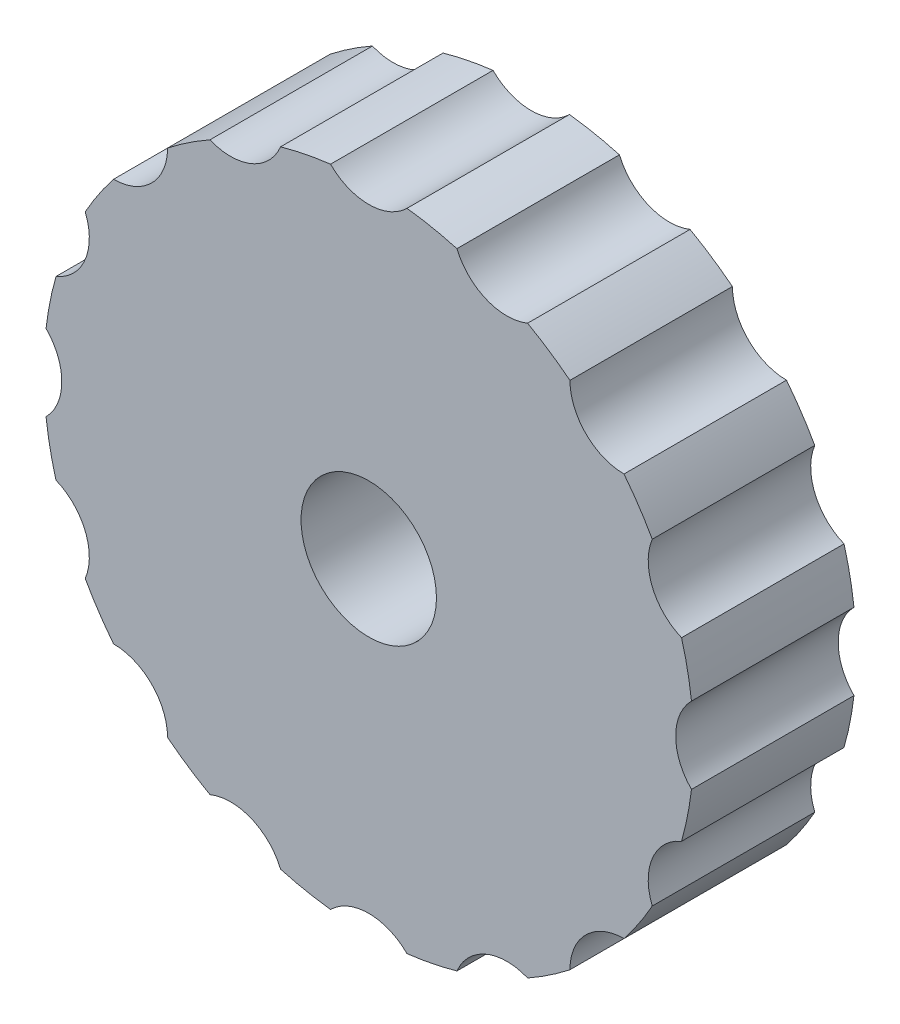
ISO-10303-21;
HEADER;
FILE_DESCRIPTION(('STEP AP214'),'2;1');
FILE_NAME('part.step','',(''),(''),'','','');
FILE_SCHEMA(('AUTOMOTIVE_DESIGN { 1 0 10303 214 1 1 1 1 }'));
ENDSEC;
DATA;
#1=APPLICATION_CONTEXT('core data for automotive mechanical design processes');
#2=APPLICATION_PROTOCOL_DEFINITION('international standard','automotive_design',2000,#1);
#3=PRODUCT_CONTEXT('',#1,'mechanical');
#4=PRODUCT('Part','Part','',(#3));
#5=PRODUCT_RELATED_PRODUCT_CATEGORY('part','',(#4));
#6=PRODUCT_DEFINITION_FORMATION('','',#4);
#7=PRODUCT_DEFINITION_CONTEXT('part definition',#1,'design');
#8=PRODUCT_DEFINITION('design','',#6,#7);
#9=PRODUCT_DEFINITION_SHAPE('','',#8);
#10=(LENGTH_UNIT() NAMED_UNIT(*) SI_UNIT(.MILLI.,.METRE.));
#11=(NAMED_UNIT(*) PLANE_ANGLE_UNIT() SI_UNIT($,.RADIAN.));
#12=(NAMED_UNIT(*) SI_UNIT($,.STERADIAN.) SOLID_ANGLE_UNIT());
#13=UNCERTAINTY_MEASURE_WITH_UNIT(LENGTH_MEASURE(1.E-05),#10,'distance_accuracy_value','');
#14=(GEOMETRIC_REPRESENTATION_CONTEXT(3) GLOBAL_UNCERTAINTY_ASSIGNED_CONTEXT((#13)) GLOBAL_UNIT_ASSIGNED_CONTEXT((#10,
#11,#12)) REPRESENTATION_CONTEXT('',''));
#15=CARTESIAN_POINT('',(0.,0.,0.));
#16=DIRECTION('',(0.,0.,1.));
#17=DIRECTION('',(1.,0.,0.));
#18=AXIS2_PLACEMENT_3D('',#15,#16,#17);
#19=CARTESIAN_POINT('',(0.,0.,9.));
#20=DIRECTION('',(0.,0.,-1.));
#21=DIRECTION('',(-1.,0.,0.));
#22=AXIS2_PLACEMENT_3D('',#19,#20,#21);
#23=CYLINDRICAL_SURFACE('',#22,18.);
#24=CARTESIAN_POINT('',(0.,0.,0.));
#25=DIRECTION('',(0.,0.,1.));
#26=DIRECTION('',(1.,0.,0.));
#27=AXIS2_PLACEMENT_3D('',#24,#25,#26);
#28=CIRCLE('',#27,18.);
#29=CARTESIAN_POINT('',(11.1421401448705,14.1369272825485,0.));
#30=VERTEX_POINT('',#29);
#31=CARTESIAN_POINT('',(8.7969053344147,15.7039630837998,0.));
#32=VERTEX_POINT('',#31);
#33=EDGE_CURVE('E256',#30,#32,#28,.T.);
#34=ORIENTED_EDGE('',*,*,#33,.T.);
#35=DIRECTION('',(0.,0.,-1.));
#36=VECTOR('',#35,1.);
#37=CARTESIAN_POINT('',(8.79690533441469,15.7039630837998,4.5));
#38=LINE('',#37,#36);
#39=CARTESIAN_POINT('',(8.79690533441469,15.7039630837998,9.));
#40=VERTEX_POINT('',#39);
#41=EDGE_CURVE('E49',#40,#32,#38,.T.);
#42=ORIENTED_EDGE('',*,*,#41,.F.);
#43=CARTESIAN_POINT('',(0.,0.,9.));
#44=DIRECTION('',(0.,0.,1.));
#45=DIRECTION('',(1.,0.,0.));
#46=AXIS2_PLACEMENT_3D('',#43,#44,#45);
#47=CIRCLE('',#46,18.);
#48=CARTESIAN_POINT('',(11.1421401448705,14.1369272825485,9.));
#49=VERTEX_POINT('',#48);
#50=EDGE_CURVE('E254',#49,#40,#47,.T.);
#51=ORIENTED_EDGE('',*,*,#50,.F.);
#52=DIRECTION('',(0.,0.,-1.));
#53=VECTOR('',#52,1.);
#54=CARTESIAN_POINT('',(11.1421401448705,14.1369272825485,4.5));
#55=LINE('',#54,#53);
#56=EDGE_CURVE('E391',#30,#49,#55,.F.);
#57=ORIENTED_EDGE('',*,*,#56,.F.);
#58=EDGE_LOOP('',(#34,#42,#51,#57));
#59=FACE_BOUND('',#58,.T.);
#60=ADVANCED_FACE('F32',(#59),#23,.T.);
#61=CARTESIAN_POINT('',(15.7039630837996,8.79690533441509,0.));
#62=VERTEX_POINT('',#61);
#63=CARTESIAN_POINT('',(14.1369272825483,11.1421401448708,0.));
#64=VERTEX_POINT('',#63);
#65=EDGE_CURVE('E401',#62,#64,#28,.T.);
#66=ORIENTED_EDGE('',*,*,#65,.T.);
#67=DIRECTION('',(0.,0.,-1.));
#68=VECTOR('',#67,1.);
#69=CARTESIAN_POINT('',(14.1369272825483,11.1421401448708,4.5));
#70=LINE('',#69,#68);
#71=CARTESIAN_POINT('',(14.1369272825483,11.1421401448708,9.));
#72=VERTEX_POINT('',#71);
#73=EDGE_CURVE('E57',#72,#64,#70,.T.);
#74=ORIENTED_EDGE('',*,*,#73,.F.);
#75=CARTESIAN_POINT('',(15.7039630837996,8.79690533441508,9.));
#76=VERTEX_POINT('',#75);
#77=EDGE_CURVE('E263',#76,#72,#47,.T.);
#78=ORIENTED_EDGE('',*,*,#77,.F.);
#79=DIRECTION('',(0.,0.,-1.));
#80=VECTOR('',#79,1.);
#81=CARTESIAN_POINT('',(15.7039630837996,8.79690533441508,4.5));
#82=LINE('',#81,#80);
#83=EDGE_CURVE('E385',#62,#76,#82,.F.);
#84=ORIENTED_EDGE('',*,*,#83,.F.);
#85=EDGE_LOOP('',(#66,#74,#78,#84));
#86=FACE_BOUND('',#85,.T.);
#87=ADVANCED_FACE('F482',(#86),#23,.T.);
#88=CARTESIAN_POINT('',(17.875,2.11763429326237,0.));
#89=VERTEX_POINT('',#88);
#90=CARTESIAN_POINT('',(17.3247302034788,4.88402737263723,0.));
#91=VERTEX_POINT('',#90);
#92=EDGE_CURVE('E468',#89,#91,#28,.T.);
#93=ORIENTED_EDGE('',*,*,#92,.T.);
#94=DIRECTION('',(0.,0.,-1.));
#95=VECTOR('',#94,1.);
#96=CARTESIAN_POINT('',(17.3247302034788,4.88402737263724,4.5));
#97=LINE('',#96,#95);
#98=CARTESIAN_POINT('',(17.3247302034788,4.88402737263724,9.));
#99=VERTEX_POINT('',#98);
#100=EDGE_CURVE('E383',#99,#91,#97,.T.);
#101=ORIENTED_EDGE('',*,*,#100,.F.);
#102=CARTESIAN_POINT('',(17.875,2.11763429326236,9.));
#103=VERTEX_POINT('',#102);
#104=EDGE_CURVE('E264',#103,#99,#47,.T.);
#105=ORIENTED_EDGE('',*,*,#104,.F.);
#106=DIRECTION('',(0.,0.,-1.));
#107=VECTOR('',#106,1.);
#108=CARTESIAN_POINT('',(17.875,2.11763429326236,4.5));
#109=LINE('',#108,#107);
#110=EDGE_CURVE('E377',#89,#103,#109,.F.);
#111=ORIENTED_EDGE('',*,*,#110,.F.);
#112=EDGE_LOOP('',(#93,#101,#105,#111));
#113=FACE_BOUND('',#112,.T.);
#114=ADVANCED_FACE('F501',(#113),#23,.T.);
#115=CARTESIAN_POINT('',(17.3247302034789,-4.88402737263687,0.));
#116=VERTEX_POINT('',#115);
#117=CARTESIAN_POINT('',(17.875,-2.117634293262,0.));
#118=VERTEX_POINT('',#117);
#119=EDGE_CURVE('E462',#116,#118,#28,.T.);
#120=ORIENTED_EDGE('',*,*,#119,.T.);
#121=DIRECTION('',(0.,0.,-1.));
#122=VECTOR('',#121,1.);
#123=CARTESIAN_POINT('',(17.875,-2.11763429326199,4.5));
#124=LINE('',#123,#122);
#125=CARTESIAN_POINT('',(17.875,-2.11763429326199,9.));
#126=VERTEX_POINT('',#125);
#127=EDGE_CURVE('E375',#126,#118,#124,.T.);
#128=ORIENTED_EDGE('',*,*,#127,.F.);
#129=CARTESIAN_POINT('',(17.3247302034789,-4.88402737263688,9.));
#130=VERTEX_POINT('',#129);
#131=EDGE_CURVE('E809',#130,#126,#47,.T.);
#132=ORIENTED_EDGE('',*,*,#131,.F.);
#133=DIRECTION('',(0.,0.,-1.));
#134=VECTOR('',#133,1.);
#135=CARTESIAN_POINT('',(17.3247302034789,-4.88402737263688,4.5));
#136=LINE('',#135,#134);
#137=EDGE_CURVE('E369',#116,#130,#136,.F.);
#138=ORIENTED_EDGE('',*,*,#137,.F.);
#139=EDGE_LOOP('',(#120,#128,#132,#138));
#140=FACE_BOUND('',#139,.T.);
#141=ADVANCED_FACE('F549',(#140),#23,.T.);
#142=CARTESIAN_POINT('',(14.1369272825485,-11.1421401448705,0.));
#143=VERTEX_POINT('',#142);
#144=CARTESIAN_POINT('',(15.7039630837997,-8.79690533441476,0.));
#145=VERTEX_POINT('',#144);
#146=EDGE_CURVE('E456',#143,#145,#28,.T.);
#147=ORIENTED_EDGE('',*,*,#146,.T.);
#148=DIRECTION('',(0.,0.,-1.));
#149=VECTOR('',#148,1.);
#150=CARTESIAN_POINT('',(15.7039630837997,-8.79690533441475,4.5));
#151=LINE('',#150,#149);
#152=CARTESIAN_POINT('',(15.7039630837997,-8.79690533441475,9.));
#153=VERTEX_POINT('',#152);
#154=EDGE_CURVE('E367',#153,#145,#151,.T.);
#155=ORIENTED_EDGE('',*,*,#154,.F.);
#156=CARTESIAN_POINT('',(14.1369272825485,-11.1421401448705,9.));
#157=VERTEX_POINT('',#156);
#158=EDGE_CURVE('E810',#157,#153,#47,.T.);
#159=ORIENTED_EDGE('',*,*,#158,.F.);
#160=DIRECTION('',(0.,0.,-1.));
#161=VECTOR('',#160,1.);
#162=CARTESIAN_POINT('',(14.1369272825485,-11.1421401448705,4.5));
#163=LINE('',#162,#161);
#164=EDGE_CURVE('E361',#143,#157,#163,.F.);
#165=ORIENTED_EDGE('',*,*,#164,.F.);
#166=EDGE_LOOP('',(#147,#155,#159,#165));
#167=FACE_BOUND('',#166,.T.);
#168=ADVANCED_FACE('F545',(#167),#23,.T.);
#169=CARTESIAN_POINT('',(8.79690533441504,-15.7039630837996,0.));
#170=VERTEX_POINT('',#169);
#171=CARTESIAN_POINT('',(11.1421401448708,-14.1369272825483,0.));
#172=VERTEX_POINT('',#171);
#173=EDGE_CURVE('E450',#170,#172,#28,.T.);
#174=ORIENTED_EDGE('',*,*,#173,.T.);
#175=DIRECTION('',(0.,0.,-1.));
#176=VECTOR('',#175,1.);
#177=CARTESIAN_POINT('',(11.1421401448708,-14.1369272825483,4.5));
#178=LINE('',#177,#176);
#179=CARTESIAN_POINT('',(11.1421401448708,-14.1369272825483,9.));
#180=VERTEX_POINT('',#179);
#181=EDGE_CURVE('E359',#180,#172,#178,.T.);
#182=ORIENTED_EDGE('',*,*,#181,.F.);
#183=CARTESIAN_POINT('',(8.79690533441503,-15.7039630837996,9.));
#184=VERTEX_POINT('',#183);
#185=EDGE_CURVE('E812',#184,#180,#47,.T.);
#186=ORIENTED_EDGE('',*,*,#185,.F.);
#187=DIRECTION('',(0.,0.,-1.));
#188=VECTOR('',#187,1.);
#189=CARTESIAN_POINT('',(8.79690533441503,-15.7039630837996,4.5));
#190=LINE('',#189,#188);
#191=EDGE_CURVE('E353',#170,#184,#190,.F.);
#192=ORIENTED_EDGE('',*,*,#191,.F.);
#193=EDGE_LOOP('',(#174,#182,#186,#192));
#194=FACE_BOUND('',#193,.T.);
#195=ADVANCED_FACE('F541',(#194),#23,.T.);
#196=CARTESIAN_POINT('',(2.11763429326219,-17.875,0.));
#197=VERTEX_POINT('',#196);
#198=CARTESIAN_POINT('',(4.88402737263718,-17.3247302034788,0.));
#199=VERTEX_POINT('',#198);
#200=EDGE_CURVE('E444',#197,#199,#28,.T.);
#201=ORIENTED_EDGE('',*,*,#200,.T.);
#202=DIRECTION('',(0.,0.,-1.));
#203=VECTOR('',#202,1.);
#204=CARTESIAN_POINT('',(4.88402737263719,-17.3247302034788,4.5));
#205=LINE('',#204,#203);
#206=CARTESIAN_POINT('',(4.88402737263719,-17.3247302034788,9.));
#207=VERTEX_POINT('',#206);
#208=EDGE_CURVE('E351',#207,#199,#205,.T.);
#209=ORIENTED_EDGE('',*,*,#208,.F.);
#210=CARTESIAN_POINT('',(2.11763429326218,-17.875,9.));
#211=VERTEX_POINT('',#210);
#212=EDGE_CURVE('E819',#211,#207,#47,.T.);
#213=ORIENTED_EDGE('',*,*,#212,.F.);
#214=DIRECTION('',(0.,0.,-1.));
#215=VECTOR('',#214,1.);
#216=CARTESIAN_POINT('',(2.11763429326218,-17.875,4.5));
#217=LINE('',#216,#215);
#218=EDGE_CURVE('E345',#197,#211,#217,.F.);
#219=ORIENTED_EDGE('',*,*,#218,.F.);
#220=EDGE_LOOP('',(#201,#209,#213,#219));
#221=FACE_BOUND('',#220,.T.);
#222=ADVANCED_FACE('F537',(#221),#23,.T.);
#223=CARTESIAN_POINT('',(-4.88402737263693,-17.3247302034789,0.));
#224=VERTEX_POINT('',#223);
#225=CARTESIAN_POINT('',(-2.11763429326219,-17.875,0.));
#226=VERTEX_POINT('',#225);
#227=EDGE_CURVE('E438',#224,#226,#28,.T.);
#228=ORIENTED_EDGE('',*,*,#227,.T.);
#229=DIRECTION('',(0.,0.,-1.));
#230=VECTOR('',#229,1.);
#231=CARTESIAN_POINT('',(-2.11763429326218,-17.875,4.5));
#232=LINE('',#231,#230);
#233=CARTESIAN_POINT('',(-2.11763429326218,-17.875,9.));
#234=VERTEX_POINT('',#233);
#235=EDGE_CURVE('E343',#234,#226,#232,.T.);
#236=ORIENTED_EDGE('',*,*,#235,.F.);
#237=CARTESIAN_POINT('',(-4.88402737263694,-17.3247302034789,9.));
#238=VERTEX_POINT('',#237);
#239=EDGE_CURVE('E823',#238,#234,#47,.T.);
#240=ORIENTED_EDGE('',*,*,#239,.F.);
#241=DIRECTION('',(0.,0.,-1.));
#242=VECTOR('',#241,1.);
#243=CARTESIAN_POINT('',(-4.88402737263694,-17.3247302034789,4.5));
#244=LINE('',#243,#242);
#245=EDGE_CURVE('E337',#224,#238,#244,.F.);
#246=ORIENTED_EDGE('',*,*,#245,.F.);
#247=EDGE_LOOP('',(#228,#236,#240,#246));
#248=FACE_BOUND('',#247,.T.);
#249=ADVANCED_FACE('F533',(#248),#23,.T.);
#250=CARTESIAN_POINT('',(-11.1421401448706,-14.1369272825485,0.));
#251=VERTEX_POINT('',#250);
#252=CARTESIAN_POINT('',(-8.79690533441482,-15.7039630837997,0.));
#253=VERTEX_POINT('',#252);
#254=EDGE_CURVE('E432',#251,#253,#28,.T.);
#255=ORIENTED_EDGE('',*,*,#254,.T.);
#256=DIRECTION('',(0.,0.,-1.));
#257=VECTOR('',#256,1.);
#258=CARTESIAN_POINT('',(-8.79690533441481,-15.7039630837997,4.5));
#259=LINE('',#258,#257);
#260=CARTESIAN_POINT('',(-8.79690533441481,-15.7039630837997,9.));
#261=VERTEX_POINT('',#260);
#262=EDGE_CURVE('E335',#261,#253,#259,.T.);
#263=ORIENTED_EDGE('',*,*,#262,.F.);
#264=CARTESIAN_POINT('',(-11.1421401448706,-14.1369272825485,9.));
#265=VERTEX_POINT('',#264);
#266=EDGE_CURVE('E827',#265,#261,#47,.T.);
#267=ORIENTED_EDGE('',*,*,#266,.F.);
#268=DIRECTION('',(0.,0.,-1.));
#269=VECTOR('',#268,1.);
#270=CARTESIAN_POINT('',(-11.1421401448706,-14.1369272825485,4.5));
#271=LINE('',#270,#269);
#272=EDGE_CURVE('E329',#251,#265,#271,.F.);
#273=ORIENTED_EDGE('',*,*,#272,.F.);
#274=EDGE_LOOP('',(#255,#263,#267,#273));
#275=FACE_BOUND('',#274,.T.);
#276=ADVANCED_FACE('F529',(#275),#23,.T.);
#277=CARTESIAN_POINT('',(-15.7039630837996,-8.79690533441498,0.));
#278=VERTEX_POINT('',#277);
#279=CARTESIAN_POINT('',(-14.1369272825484,-11.1421401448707,0.));
#280=VERTEX_POINT('',#279);
#281=EDGE_CURVE('E426',#278,#280,#28,.T.);
#282=ORIENTED_EDGE('',*,*,#281,.T.);
#283=DIRECTION('',(0.,0.,-1.));
#284=VECTOR('',#283,1.);
#285=CARTESIAN_POINT('',(-14.1369272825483,-11.1421401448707,4.5));
#286=LINE('',#285,#284);
#287=CARTESIAN_POINT('',(-14.1369272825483,-11.1421401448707,9.));
#288=VERTEX_POINT('',#287);
#289=EDGE_CURVE('E327',#288,#280,#286,.T.);
#290=ORIENTED_EDGE('',*,*,#289,.F.);
#291=CARTESIAN_POINT('',(-15.7039630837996,-8.79690533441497,9.));
#292=VERTEX_POINT('',#291);
#293=EDGE_CURVE('E831',#292,#288,#47,.T.);
#294=ORIENTED_EDGE('',*,*,#293,.F.);
#295=DIRECTION('',(0.,0.,-1.));
#296=VECTOR('',#295,1.);
#297=CARTESIAN_POINT('',(-15.7039630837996,-8.79690533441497,4.5));
#298=LINE('',#297,#296);
#299=EDGE_CURVE('E321',#278,#292,#298,.F.);
#300=ORIENTED_EDGE('',*,*,#299,.F.);
#301=EDGE_LOOP('',(#282,#290,#294,#300));
#302=FACE_BOUND('',#301,.T.);
#303=ADVANCED_FACE('F525',(#302),#23,.T.);
#304=CARTESIAN_POINT('',(-17.875,-2.11763429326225,0.));
#305=VERTEX_POINT('',#304);
#306=CARTESIAN_POINT('',(-17.3247302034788,-4.88402737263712,0.));
#307=VERTEX_POINT('',#306);
#308=EDGE_CURVE('E420',#305,#307,#28,.T.);
#309=ORIENTED_EDGE('',*,*,#308,.T.);
#310=DIRECTION('',(0.,0.,-1.));
#311=VECTOR('',#310,1.);
#312=CARTESIAN_POINT('',(-17.3247302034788,-4.88402737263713,4.5));
#313=LINE('',#312,#311);
#314=CARTESIAN_POINT('',(-17.3247302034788,-4.88402737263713,9.));
#315=VERTEX_POINT('',#314);
#316=EDGE_CURVE('E319',#315,#307,#313,.T.);
#317=ORIENTED_EDGE('',*,*,#316,.F.);
#318=CARTESIAN_POINT('',(-17.875,-2.11763429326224,9.));
#319=VERTEX_POINT('',#318);
#320=EDGE_CURVE('E835',#319,#315,#47,.T.);
#321=ORIENTED_EDGE('',*,*,#320,.F.);
#322=DIRECTION('',(0.,0.,-1.));
#323=VECTOR('',#322,1.);
#324=CARTESIAN_POINT('',(-17.875,-2.11763429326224,4.5));
#325=LINE('',#324,#323);
#326=EDGE_CURVE('E313',#305,#319,#325,.F.);
#327=ORIENTED_EDGE('',*,*,#326,.F.);
#328=EDGE_LOOP('',(#309,#317,#321,#327));
#329=FACE_BOUND('',#328,.T.);
#330=ADVANCED_FACE('F521',(#329),#23,.T.);
#331=CARTESIAN_POINT('',(-17.3247302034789,4.884027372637,0.));
#332=VERTEX_POINT('',#331);
#333=CARTESIAN_POINT('',(-17.875,2.11763429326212,0.));
#334=VERTEX_POINT('',#333);
#335=EDGE_CURVE('E414',#332,#334,#28,.T.);
#336=ORIENTED_EDGE('',*,*,#335,.T.);
#337=DIRECTION('',(0.,0.,-1.));
#338=VECTOR('',#337,1.);
#339=CARTESIAN_POINT('',(-17.875,2.11763429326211,4.5));
#340=LINE('',#339,#338);
#341=CARTESIAN_POINT('',(-17.875,2.11763429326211,9.));
#342=VERTEX_POINT('',#341);
#343=EDGE_CURVE('E311',#342,#334,#340,.T.);
#344=ORIENTED_EDGE('',*,*,#343,.F.);
#345=CARTESIAN_POINT('',(-17.3247302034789,4.884027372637,9.));
#346=VERTEX_POINT('',#345);
#347=EDGE_CURVE('E839',#346,#342,#47,.T.);
#348=ORIENTED_EDGE('',*,*,#347,.F.);
#349=DIRECTION('',(0.,0.,-1.));
#350=VECTOR('',#349,1.);
#351=CARTESIAN_POINT('',(-17.3247302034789,4.884027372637,4.5));
#352=LINE('',#351,#350);
#353=EDGE_CURVE('E305',#332,#346,#352,.F.);
#354=ORIENTED_EDGE('',*,*,#353,.F.);
#355=EDGE_LOOP('',(#336,#344,#348,#354));
#356=FACE_BOUND('',#355,.T.);
#357=ADVANCED_FACE('F517',(#356),#23,.T.);
#358=CARTESIAN_POINT('',(-14.1369272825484,11.1421401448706,0.));
#359=VERTEX_POINT('',#358);
#360=CARTESIAN_POINT('',(-15.7039630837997,8.79690533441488,0.));
#361=VERTEX_POINT('',#360);
#362=EDGE_CURVE('E408',#359,#361,#28,.T.);
#363=ORIENTED_EDGE('',*,*,#362,.T.);
#364=DIRECTION('',(0.,0.,-1.));
#365=VECTOR('',#364,1.);
#366=CARTESIAN_POINT('',(-15.7039630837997,8.79690533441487,4.5));
#367=LINE('',#366,#365);
#368=CARTESIAN_POINT('',(-15.7039630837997,8.79690533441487,9.));
#369=VERTEX_POINT('',#368);
#370=EDGE_CURVE('E303',#369,#361,#367,.T.);
#371=ORIENTED_EDGE('',*,*,#370,.F.);
#372=CARTESIAN_POINT('',(-14.1369272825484,11.1421401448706,9.));
#373=VERTEX_POINT('',#372);
#374=EDGE_CURVE('E843',#373,#369,#47,.T.);
#375=ORIENTED_EDGE('',*,*,#374,.F.);
#376=DIRECTION('',(0.,0.,-1.));
#377=VECTOR('',#376,1.);
#378=CARTESIAN_POINT('',(-14.1369272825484,11.1421401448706,4.5));
#379=LINE('',#378,#377);
#380=EDGE_CURVE('E297',#359,#373,#379,.F.);
#381=ORIENTED_EDGE('',*,*,#380,.F.);
#382=EDGE_LOOP('',(#363,#371,#375,#381));
#383=FACE_BOUND('',#382,.T.);
#384=ADVANCED_FACE('F513',(#383),#23,.T.);
#385=CARTESIAN_POINT('',(-8.79690533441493,15.7039630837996,0.));
#386=VERTEX_POINT('',#385);
#387=CARTESIAN_POINT('',(-11.1421401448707,14.1369272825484,0.));
#388=VERTEX_POINT('',#387);
#389=EDGE_CURVE('E403',#386,#388,#28,.T.);
#390=ORIENTED_EDGE('',*,*,#389,.T.);
#391=DIRECTION('',(0.,0.,-1.));
#392=VECTOR('',#391,1.);
#393=CARTESIAN_POINT('',(-11.1421401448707,14.1369272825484,4.5));
#394=LINE('',#393,#392);
#395=CARTESIAN_POINT('',(-11.1421401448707,14.1369272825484,9.));
#396=VERTEX_POINT('',#395);
#397=EDGE_CURVE('E295',#396,#388,#394,.T.);
#398=ORIENTED_EDGE('',*,*,#397,.F.);
#399=CARTESIAN_POINT('',(-8.79690533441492,15.7039630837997,9.));
#400=VERTEX_POINT('',#399);
#401=EDGE_CURVE('E41',#400,#396,#47,.T.);
#402=ORIENTED_EDGE('',*,*,#401,.F.);
#403=DIRECTION('',(0.,0.,-1.));
#404=VECTOR('',#403,1.);
#405=CARTESIAN_POINT('',(-8.79690533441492,15.7039630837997,4.5));
#406=LINE('',#405,#404);
#407=EDGE_CURVE('E289',#386,#400,#406,.F.);
#408=ORIENTED_EDGE('',*,*,#407,.F.);
#409=EDGE_LOOP('',(#390,#398,#402,#408));
#410=FACE_BOUND('',#409,.T.);
#411=ADVANCED_FACE('F509',(#410),#23,.T.);
#412=CARTESIAN_POINT('',(-2.11763429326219,17.875,0.));
#413=VERTEX_POINT('',#412);
#414=CARTESIAN_POINT('',(-4.88402737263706,17.3247302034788,0.));
#415=VERTEX_POINT('',#414);
#416=EDGE_CURVE('E36',#413,#415,#28,.T.);
#417=ORIENTED_EDGE('',*,*,#416,.T.);
#418=DIRECTION('',(0.,0.,-1.));
#419=VECTOR('',#418,1.);
#420=CARTESIAN_POINT('',(-4.88402737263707,17.3247302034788,4.5));
#421=LINE('',#420,#419);
#422=CARTESIAN_POINT('',(-4.88402737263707,17.3247302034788,9.));
#423=VERTEX_POINT('',#422);
#424=EDGE_CURVE('E287',#423,#415,#421,.T.);
#425=ORIENTED_EDGE('',*,*,#424,.F.);
#426=CARTESIAN_POINT('',(-2.11763429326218,17.875,9.));
#427=VERTEX_POINT('',#426);
#428=EDGE_CURVE('E11',#427,#423,#47,.T.);
#429=ORIENTED_EDGE('',*,*,#428,.F.);
#430=DIRECTION('',(0.,0.,-1.));
#431=VECTOR('',#430,1.);
#432=CARTESIAN_POINT('',(-2.11763429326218,17.875,4.5));
#433=LINE('',#432,#431);
#434=EDGE_CURVE('E281',#413,#427,#433,.F.);
#435=ORIENTED_EDGE('',*,*,#434,.F.);
#436=EDGE_LOOP('',(#417,#425,#429,#435));
#437=FACE_BOUND('',#436,.T.);
#438=ADVANCED_FACE('F503',(#437),#23,.T.);
#439=CARTESIAN_POINT('',(4.88402737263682,17.3247302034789,9.));
#440=VERTEX_POINT('',#439);
#441=CARTESIAN_POINT('',(2.11763429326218,17.875,9.));
#442=VERTEX_POINT('',#441);
#443=EDGE_CURVE('E42',#440,#442,#47,.T.);
#444=ORIENTED_EDGE('',*,*,#443,.F.);
#445=DIRECTION('',(0.,0.,-1.));
#446=VECTOR('',#445,1.);
#447=CARTESIAN_POINT('',(4.88402737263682,17.3247302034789,4.5));
#448=LINE('',#447,#446);
#449=CARTESIAN_POINT('',(4.8840273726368,17.3247302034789,0.));
#450=VERTEX_POINT('',#449);
#451=EDGE_CURVE('E244',#450,#440,#448,.F.);
#452=ORIENTED_EDGE('',*,*,#451,.F.);
#453=CARTESIAN_POINT('',(2.11763429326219,17.875,0.));
#454=VERTEX_POINT('',#453);
#455=EDGE_CURVE('E273',#450,#454,#28,.T.);
#456=ORIENTED_EDGE('',*,*,#455,.T.);
#457=DIRECTION('',(0.,0.,-1.));
#458=VECTOR('',#457,1.);
#459=CARTESIAN_POINT('',(2.11763429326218,17.875,4.5));
#460=LINE('',#459,#458);
#461=EDGE_CURVE('E278',#442,#454,#460,.T.);
#462=ORIENTED_EDGE('',*,*,#461,.F.);
#463=EDGE_LOOP('',(#444,#452,#456,#462));
#464=FACE_BOUND('',#463,.T.);
#465=ADVANCED_FACE('F34',(#464),#23,.T.);
#466=CARTESIAN_POINT('',(0.,0.,9.));
#467=DIRECTION('',(0.,0.,1.));
#468=DIRECTION('',(1.,0.,0.));
#469=AXIS2_PLACEMENT_3D('',#466,#467,#468);
#470=PLANE('',#469);
#471=CARTESIAN_POINT('',(7.65366864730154,18.4775906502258,9.));
#472=DIRECTION('',(0.,0.,1.));
#473=DIRECTION('',(0.923879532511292,-0.382683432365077,0.));
#474=AXIS2_PLACEMENT_3D('',#471,#472,#473);
#475=CIRCLE('',#474,3.);
#476=EDGE_CURVE('E241',#440,#40,#475,.T.);
#477=ORIENTED_EDGE('',*,*,#476,.F.);
#478=ORIENTED_EDGE('',*,*,#443,.T.);
#479=CARTESIAN_POINT('',(0.,20.,9.));
#480=DIRECTION('',(0.,0.,1.));
#481=DIRECTION('',(1.,0.,0.));
#482=AXIS2_PLACEMENT_3D('',#479,#480,#481);
#483=CIRCLE('',#482,3.);
#484=EDGE_CURVE('E275',#427,#442,#483,.T.);
#485=ORIENTED_EDGE('',*,*,#484,.F.);
#486=ORIENTED_EDGE('',*,*,#428,.T.);
#487=CARTESIAN_POINT('',(-7.65366864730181,18.4775906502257,9.));
#488=DIRECTION('',(0.,0.,1.));
#489=DIRECTION('',(0.923879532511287,0.382683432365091,0.));
#490=AXIS2_PLACEMENT_3D('',#487,#488,#489);
#491=CIRCLE('',#490,3.);
#492=EDGE_CURVE('E285',#400,#423,#491,.T.);
#493=ORIENTED_EDGE('',*,*,#492,.F.);
#494=ORIENTED_EDGE('',*,*,#401,.T.);
#495=CARTESIAN_POINT('',(-14.142135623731,14.1421356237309,9.));
#496=DIRECTION('',(0.,0.,1.));
#497=DIRECTION('',(0.707106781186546,0.707106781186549,0.));
#498=AXIS2_PLACEMENT_3D('',#495,#496,#497);
#499=CIRCLE('',#498,3.);
#500=EDGE_CURVE('E293',#373,#396,#499,.T.);
#501=ORIENTED_EDGE('',*,*,#500,.F.);
#502=ORIENTED_EDGE('',*,*,#374,.T.);
#503=CARTESIAN_POINT('',(-18.4775906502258,7.65366864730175,9.));
#504=DIRECTION('',(0.,0.,1.));
#505=DIRECTION('',(0.382683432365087,0.923879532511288,0.));
#506=AXIS2_PLACEMENT_3D('',#503,#504,#505);
#507=CIRCLE('',#506,3.);
#508=EDGE_CURVE('E301',#346,#369,#507,.T.);
#509=ORIENTED_EDGE('',*,*,#508,.F.);
#510=ORIENTED_EDGE('',*,*,#347,.T.);
#511=CARTESIAN_POINT('',(-20.,0.,9.));
#512=DIRECTION('',(0.,0.,1.));
#513=DIRECTION('',(0.,1.,0.));
#514=AXIS2_PLACEMENT_3D('',#511,#512,#513);
#515=CIRCLE('',#514,3.);
#516=EDGE_CURVE('E309',#319,#342,#515,.T.);
#517=ORIENTED_EDGE('',*,*,#516,.F.);
#518=ORIENTED_EDGE('',*,*,#320,.T.);
#519=CARTESIAN_POINT('',(-18.4775906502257,-7.65366864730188,9.));
#520=DIRECTION('',(0.,0.,1.));
#521=DIRECTION('',(-0.382683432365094,0.923879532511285,0.));
#522=AXIS2_PLACEMENT_3D('',#519,#520,#521);
#523=CIRCLE('',#522,3.);
#524=EDGE_CURVE('E317',#292,#315,#523,.T.);
#525=ORIENTED_EDGE('',*,*,#524,.F.);
#526=ORIENTED_EDGE('',*,*,#293,.T.);
#527=CARTESIAN_POINT('',(-14.1421356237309,-14.142135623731,9.));
#528=DIRECTION('',(0.,0.,1.));
#529=DIRECTION('',(-0.707106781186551,0.707106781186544,0.));
#530=AXIS2_PLACEMENT_3D('',#527,#528,#529);
#531=CIRCLE('',#530,3.);
#532=EDGE_CURVE('E325',#265,#288,#531,.T.);
#533=ORIENTED_EDGE('',*,*,#532,.F.);
#534=ORIENTED_EDGE('',*,*,#266,.T.);
#535=CARTESIAN_POINT('',(-7.65366864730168,-18.4775906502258,9.));
#536=DIRECTION('',(0.,0.,1.));
#537=DIRECTION('',(-0.923879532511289,0.382683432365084,0.));
#538=AXIS2_PLACEMENT_3D('',#535,#536,#537);
#539=CIRCLE('',#538,3.);
#540=EDGE_CURVE('E333',#238,#261,#539,.T.);
#541=ORIENTED_EDGE('',*,*,#540,.F.);
#542=ORIENTED_EDGE('',*,*,#239,.T.);
#543=CARTESIAN_POINT('',(0.,-20.,9.));
#544=DIRECTION('',(0.,0.,1.));
#545=DIRECTION('',(-1.,0.,0.));
#546=AXIS2_PLACEMENT_3D('',#543,#544,#545);
#547=CIRCLE('',#546,3.);
#548=EDGE_CURVE('E341',#211,#234,#547,.T.);
#549=ORIENTED_EDGE('',*,*,#548,.F.);
#550=ORIENTED_EDGE('',*,*,#212,.T.);
#551=CARTESIAN_POINT('',(7.65366864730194,-18.4775906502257,9.));
#552=DIRECTION('',(0.,0.,1.));
#553=DIRECTION('',(-0.923879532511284,-0.382683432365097,0.));
#554=AXIS2_PLACEMENT_3D('',#551,#552,#553);
#555=CIRCLE('',#554,3.);
#556=EDGE_CURVE('E349',#184,#207,#555,.T.);
#557=ORIENTED_EDGE('',*,*,#556,.F.);
#558=ORIENTED_EDGE('',*,*,#185,.T.);
#559=CARTESIAN_POINT('',(14.1421356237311,-14.1421356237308,9.));
#560=DIRECTION('',(0.,0.,1.));
#561=DIRECTION('',(-0.707106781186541,-0.707106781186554,0.));
#562=AXIS2_PLACEMENT_3D('',#559,#560,#561);
#563=CIRCLE('',#562,3.);
#564=EDGE_CURVE('E357',#157,#180,#563,.T.);
#565=ORIENTED_EDGE('',*,*,#564,.F.);
#566=ORIENTED_EDGE('',*,*,#158,.T.);
#567=CARTESIAN_POINT('',(18.4775906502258,-7.65366864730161,9.));
#568=DIRECTION('',(0.,0.,1.));
#569=DIRECTION('',(-0.382683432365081,-0.923879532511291,0.));
#570=AXIS2_PLACEMENT_3D('',#567,#568,#569);
#571=CIRCLE('',#570,3.);
#572=EDGE_CURVE('E365',#130,#153,#571,.T.);
#573=ORIENTED_EDGE('',*,*,#572,.F.);
#574=ORIENTED_EDGE('',*,*,#131,.T.);
#575=CARTESIAN_POINT('',(20.,2.09488880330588E-13,9.));
#576=DIRECTION('',(0.,0.,1.));
#577=DIRECTION('',(0.,-1.,0.));
#578=AXIS2_PLACEMENT_3D('',#575,#576,#577);
#579=CIRCLE('',#578,3.);
#580=EDGE_CURVE('E373',#103,#126,#579,.T.);
#581=ORIENTED_EDGE('',*,*,#580,.F.);
#582=ORIENTED_EDGE('',*,*,#104,.T.);
#583=CARTESIAN_POINT('',(18.4775906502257,7.653668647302,9.));
#584=DIRECTION('',(0.,0.,1.));
#585=DIRECTION('',(0.3826834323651,-0.923879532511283,0.));
#586=AXIS2_PLACEMENT_3D('',#583,#584,#585);
#587=CIRCLE('',#586,3.);
#588=EDGE_CURVE('E381',#76,#99,#587,.T.);
#589=ORIENTED_EDGE('',*,*,#588,.F.);
#590=ORIENTED_EDGE('',*,*,#77,.T.);
#591=CARTESIAN_POINT('',(14.1421356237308,14.1421356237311,9.));
#592=DIRECTION('',(0.,0.,1.));
#593=DIRECTION('',(0.707106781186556,-0.707106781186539,0.));
#594=AXIS2_PLACEMENT_3D('',#591,#592,#593);
#595=CIRCLE('',#594,3.);
#596=EDGE_CURVE('E262',#49,#72,#595,.T.);
#597=ORIENTED_EDGE('',*,*,#596,.F.);
#598=ORIENTED_EDGE('',*,*,#50,.T.);
#599=EDGE_LOOP('',(#477,#478,#485,#486,#493,#494,#501,#502,#509,#510,#517,#518,#525,#526,#533,
#534,#541,#542,#549,#550,#557,#558,#565,#566,#573,#574,#581,#582,#589,#590,#597,#598));
#600=FACE_BOUND('',#599,.T.);
#601=CARTESIAN_POINT('',(0.,0.,9.));
#602=DIRECTION('',(0.,0.,1.));
#603=DIRECTION('',(1.,0.,0.));
#604=AXIS2_PLACEMENT_3D('',#601,#602,#603);
#605=CIRCLE('',#604,3.75);
#606=CARTESIAN_POINT('',(3.75,0.,9.));
#607=VERTEX_POINT('',#606);
#608=EDGE_CURVE('E266',#607,#607,#605,.T.);
#609=ORIENTED_EDGE('',*,*,#608,.F.);
#610=EDGE_LOOP('',(#609));
#611=FACE_BOUND('',#610,.T.);
#612=ADVANCED_FACE('F259',(#600,#611),#470,.T.);
#613=CARTESIAN_POINT('',(0.,0.,0.));
#614=DIRECTION('',(0.,0.,1.));
#615=DIRECTION('',(1.,0.,0.));
#616=AXIS2_PLACEMENT_3D('',#613,#614,#615);
#617=PLANE('',#616);
#618=ORIENTED_EDGE('',*,*,#455,.F.);
#619=CARTESIAN_POINT('',(7.65366864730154,18.4775906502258,0.));
#620=DIRECTION('',(0.,0.,1.));
#621=DIRECTION('',(1.,0.,0.));
#622=AXIS2_PLACEMENT_3D('',#619,#620,#621);
#623=CIRCLE('',#622,3.);
#624=EDGE_CURVE('E248',#32,#450,#623,.F.);
#625=ORIENTED_EDGE('',*,*,#624,.F.);
#626=ORIENTED_EDGE('',*,*,#33,.F.);
#627=CARTESIAN_POINT('',(14.1421356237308,14.1421356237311,0.));
#628=DIRECTION('',(0.,0.,1.));
#629=DIRECTION('',(1.,0.,0.));
#630=AXIS2_PLACEMENT_3D('',#627,#628,#629);
#631=CIRCLE('',#630,3.);
#632=EDGE_CURVE('E387',#64,#30,#631,.F.);
#633=ORIENTED_EDGE('',*,*,#632,.F.);
#634=ORIENTED_EDGE('',*,*,#65,.F.);
#635=CARTESIAN_POINT('',(18.4775906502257,7.653668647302,0.));
#636=DIRECTION('',(0.,0.,1.));
#637=DIRECTION('',(1.,0.,0.));
#638=AXIS2_PLACEMENT_3D('',#635,#636,#637);
#639=CIRCLE('',#638,3.);
#640=EDGE_CURVE('E379',#91,#62,#639,.F.);
#641=ORIENTED_EDGE('',*,*,#640,.F.);
#642=ORIENTED_EDGE('',*,*,#92,.F.);
#643=CARTESIAN_POINT('',(20.,2.09488880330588E-13,0.));
#644=DIRECTION('',(0.,0.,1.));
#645=DIRECTION('',(1.,0.,0.));
#646=AXIS2_PLACEMENT_3D('',#643,#644,#645);
#647=CIRCLE('',#646,3.);
#648=EDGE_CURVE('E371',#118,#89,#647,.F.);
#649=ORIENTED_EDGE('',*,*,#648,.F.);
#650=ORIENTED_EDGE('',*,*,#119,.F.);
#651=CARTESIAN_POINT('',(18.4775906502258,-7.65366864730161,0.));
#652=DIRECTION('',(0.,0.,1.));
#653=DIRECTION('',(1.,0.,0.));
#654=AXIS2_PLACEMENT_3D('',#651,#652,#653);
#655=CIRCLE('',#654,3.);
#656=EDGE_CURVE('E363',#145,#116,#655,.F.);
#657=ORIENTED_EDGE('',*,*,#656,.F.);
#658=ORIENTED_EDGE('',*,*,#146,.F.);
#659=CARTESIAN_POINT('',(14.1421356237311,-14.1421356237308,0.));
#660=DIRECTION('',(0.,0.,1.));
#661=DIRECTION('',(1.,0.,0.));
#662=AXIS2_PLACEMENT_3D('',#659,#660,#661);
#663=CIRCLE('',#662,3.);
#664=EDGE_CURVE('E355',#172,#143,#663,.F.);
#665=ORIENTED_EDGE('',*,*,#664,.F.);
#666=ORIENTED_EDGE('',*,*,#173,.F.);
#667=CARTESIAN_POINT('',(7.65366864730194,-18.4775906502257,0.));
#668=DIRECTION('',(0.,0.,1.));
#669=DIRECTION('',(1.,0.,0.));
#670=AXIS2_PLACEMENT_3D('',#667,#668,#669);
#671=CIRCLE('',#670,3.);
#672=EDGE_CURVE('E347',#199,#170,#671,.F.);
#673=ORIENTED_EDGE('',*,*,#672,.F.);
#674=ORIENTED_EDGE('',*,*,#200,.F.);
#675=CARTESIAN_POINT('',(0.,-20.,0.));
#676=DIRECTION('',(0.,0.,1.));
#677=DIRECTION('',(1.,0.,0.));
#678=AXIS2_PLACEMENT_3D('',#675,#676,#677);
#679=CIRCLE('',#678,3.);
#680=EDGE_CURVE('E339',#226,#197,#679,.F.);
#681=ORIENTED_EDGE('',*,*,#680,.F.);
#682=ORIENTED_EDGE('',*,*,#227,.F.);
#683=CARTESIAN_POINT('',(-7.65366864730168,-18.4775906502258,0.));
#684=DIRECTION('',(0.,0.,1.));
#685=DIRECTION('',(1.,0.,0.));
#686=AXIS2_PLACEMENT_3D('',#683,#684,#685);
#687=CIRCLE('',#686,3.);
#688=EDGE_CURVE('E331',#253,#224,#687,.F.);
#689=ORIENTED_EDGE('',*,*,#688,.F.);
#690=ORIENTED_EDGE('',*,*,#254,.F.);
#691=CARTESIAN_POINT('',(-14.1421356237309,-14.142135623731,0.));
#692=DIRECTION('',(0.,0.,1.));
#693=DIRECTION('',(1.,0.,0.));
#694=AXIS2_PLACEMENT_3D('',#691,#692,#693);
#695=CIRCLE('',#694,3.);
#696=EDGE_CURVE('E323',#280,#251,#695,.F.);
#697=ORIENTED_EDGE('',*,*,#696,.F.);
#698=ORIENTED_EDGE('',*,*,#281,.F.);
#699=CARTESIAN_POINT('',(-18.4775906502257,-7.65366864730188,0.));
#700=DIRECTION('',(0.,0.,1.));
#701=DIRECTION('',(1.,0.,0.));
#702=AXIS2_PLACEMENT_3D('',#699,#700,#701);
#703=CIRCLE('',#702,3.);
#704=EDGE_CURVE('E315',#307,#278,#703,.F.);
#705=ORIENTED_EDGE('',*,*,#704,.F.);
#706=ORIENTED_EDGE('',*,*,#308,.F.);
#707=CARTESIAN_POINT('',(-20.,0.,0.));
#708=DIRECTION('',(0.,0.,1.));
#709=DIRECTION('',(1.,0.,0.));
#710=AXIS2_PLACEMENT_3D('',#707,#708,#709);
#711=CIRCLE('',#710,3.);
#712=EDGE_CURVE('E307',#334,#305,#711,.F.);
#713=ORIENTED_EDGE('',*,*,#712,.F.);
#714=ORIENTED_EDGE('',*,*,#335,.F.);
#715=CARTESIAN_POINT('',(-18.4775906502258,7.65366864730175,0.));
#716=DIRECTION('',(0.,0.,1.));
#717=DIRECTION('',(1.,0.,0.));
#718=AXIS2_PLACEMENT_3D('',#715,#716,#717);
#719=CIRCLE('',#718,3.);
#720=EDGE_CURVE('E299',#361,#332,#719,.F.);
#721=ORIENTED_EDGE('',*,*,#720,.F.);
#722=ORIENTED_EDGE('',*,*,#362,.F.);
#723=CARTESIAN_POINT('',(-14.142135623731,14.1421356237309,0.));
#724=DIRECTION('',(0.,0.,1.));
#725=DIRECTION('',(1.,0.,0.));
#726=AXIS2_PLACEMENT_3D('',#723,#724,#725);
#727=CIRCLE('',#726,3.);
#728=EDGE_CURVE('E291',#388,#359,#727,.F.);
#729=ORIENTED_EDGE('',*,*,#728,.F.);
#730=ORIENTED_EDGE('',*,*,#389,.F.);
#731=CARTESIAN_POINT('',(-7.65366864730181,18.4775906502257,0.));
#732=DIRECTION('',(0.,0.,1.));
#733=DIRECTION('',(1.,0.,0.));
#734=AXIS2_PLACEMENT_3D('',#731,#732,#733);
#735=CIRCLE('',#734,3.);
#736=EDGE_CURVE('E283',#415,#386,#735,.F.);
#737=ORIENTED_EDGE('',*,*,#736,.F.);
#738=ORIENTED_EDGE('',*,*,#416,.F.);
#739=CARTESIAN_POINT('',(0.,20.,0.));
#740=DIRECTION('',(0.,0.,1.));
#741=DIRECTION('',(1.,0.,0.));
#742=AXIS2_PLACEMENT_3D('',#739,#740,#741);
#743=CIRCLE('',#742,3.);
#744=EDGE_CURVE('E270',#454,#413,#743,.F.);
#745=ORIENTED_EDGE('',*,*,#744,.F.);
#746=EDGE_LOOP('',(#618,#625,#626,#633,#634,#641,#642,#649,#650,#657,#658,#665,#666,#673,#674,
#681,#682,#689,#690,#697,#698,#705,#706,#713,#714,#721,#722,#729,#730,#737,#738,#745));
#747=FACE_BOUND('',#746,.T.);
#748=ADVANCED_FACE('F399',(#747),#617,.F.);
#749=CARTESIAN_POINT('',(0.,0.,2.));
#750=DIRECTION('',(0.,0.,1.));
#751=DIRECTION('',(1.,0.,0.));
#752=AXIS2_PLACEMENT_3D('',#749,#750,#751);
#753=CYLINDRICAL_SURFACE('',#752,3.75);
#754=CARTESIAN_POINT('',(0.,0.,2.));
#755=DIRECTION('',(0.,0.,1.));
#756=DIRECTION('',(1.,0.,0.));
#757=AXIS2_PLACEMENT_3D('',#754,#755,#756);
#758=CIRCLE('',#757,3.75);
#759=CARTESIAN_POINT('',(3.75,0.,2.));
#760=VERTEX_POINT('',#759);
#761=EDGE_CURVE('E269',#760,#760,#758,.T.);
#762=ORIENTED_EDGE('',*,*,#761,.F.);
#763=EDGE_LOOP('',(#762));
#764=FACE_BOUND('',#763,.T.);
#765=ORIENTED_EDGE('',*,*,#608,.T.);
#766=EDGE_LOOP('',(#765));
#767=FACE_BOUND('',#766,.T.);
#768=ADVANCED_FACE('F590',(#764,#767),#753,.F.);
#769=CARTESIAN_POINT('',(0.,0.,2.));
#770=DIRECTION('',(0.,0.,1.));
#771=DIRECTION('',(1.,0.,0.));
#772=AXIS2_PLACEMENT_3D('',#769,#770,#771);
#773=PLANE('',#772);
#774=ORIENTED_EDGE('',*,*,#761,.T.);
#775=EDGE_LOOP('',(#774));
#776=FACE_BOUND('',#775,.T.);
#777=ADVANCED_FACE('F578',(#776),#773,.T.);
#778=CARTESIAN_POINT('',(0.,20.,-0.000999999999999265));
#779=DIRECTION('',(0.,0.,1.));
#780=DIRECTION('',(1.,0.,0.));
#781=AXIS2_PLACEMENT_3D('',#778,#779,#780);
#782=CYLINDRICAL_SURFACE('',#781,3.);
#783=ORIENTED_EDGE('',*,*,#461,.T.);
#784=ORIENTED_EDGE('',*,*,#744,.T.);
#785=ORIENTED_EDGE('',*,*,#434,.T.);
#786=ORIENTED_EDGE('',*,*,#484,.T.);
#787=EDGE_LOOP('',(#783,#784,#785,#786));
#788=FACE_BOUND('',#787,.T.);
#789=ADVANCED_FACE('F572',(#788),#782,.F.);
#790=CARTESIAN_POINT('',(-7.65366864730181,18.4775906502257,-0.000999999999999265));
#791=DIRECTION('',(0.,0.,1.));
#792=DIRECTION('',(1.,0.,0.));
#793=AXIS2_PLACEMENT_3D('',#790,#791,#792);
#794=CYLINDRICAL_SURFACE('',#793,3.);
#795=ORIENTED_EDGE('',*,*,#424,.T.);
#796=ORIENTED_EDGE('',*,*,#736,.T.);
#797=ORIENTED_EDGE('',*,*,#407,.T.);
#798=ORIENTED_EDGE('',*,*,#492,.T.);
#799=EDGE_LOOP('',(#795,#796,#797,#798));
#800=FACE_BOUND('',#799,.T.);
#801=ADVANCED_FACE('F577',(#800),#794,.F.);
#802=CARTESIAN_POINT('',(-14.142135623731,14.1421356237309,-0.000999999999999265));
#803=DIRECTION('',(0.,0.,1.));
#804=DIRECTION('',(1.,0.,0.));
#805=AXIS2_PLACEMENT_3D('',#802,#803,#804);
#806=CYLINDRICAL_SURFACE('',#805,3.);
#807=ORIENTED_EDGE('',*,*,#397,.T.);
#808=ORIENTED_EDGE('',*,*,#728,.T.);
#809=ORIENTED_EDGE('',*,*,#380,.T.);
#810=ORIENTED_EDGE('',*,*,#500,.T.);
#811=EDGE_LOOP('',(#807,#808,#809,#810));
#812=FACE_BOUND('',#811,.T.);
#813=ADVANCED_FACE('F673',(#812),#806,.F.);
#814=CARTESIAN_POINT('',(-18.4775906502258,7.65366864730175,-0.000999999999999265));
#815=DIRECTION('',(0.,0.,1.));
#816=DIRECTION('',(1.,0.,0.));
#817=AXIS2_PLACEMENT_3D('',#814,#815,#816);
#818=CYLINDRICAL_SURFACE('',#817,3.);
#819=ORIENTED_EDGE('',*,*,#370,.T.);
#820=ORIENTED_EDGE('',*,*,#720,.T.);
#821=ORIENTED_EDGE('',*,*,#353,.T.);
#822=ORIENTED_EDGE('',*,*,#508,.T.);
#823=EDGE_LOOP('',(#819,#820,#821,#822));
#824=FACE_BOUND('',#823,.T.);
#825=ADVANCED_FACE('F683',(#824),#818,.F.);
#826=CARTESIAN_POINT('',(-20.,0.,-0.000999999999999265));
#827=DIRECTION('',(0.,0.,1.));
#828=DIRECTION('',(1.,0.,0.));
#829=AXIS2_PLACEMENT_3D('',#826,#827,#828);
#830=CYLINDRICAL_SURFACE('',#829,3.);
#831=ORIENTED_EDGE('',*,*,#343,.T.);
#832=ORIENTED_EDGE('',*,*,#712,.T.);
#833=ORIENTED_EDGE('',*,*,#326,.T.);
#834=ORIENTED_EDGE('',*,*,#516,.T.);
#835=EDGE_LOOP('',(#831,#832,#833,#834));
#836=FACE_BOUND('',#835,.T.);
#837=ADVANCED_FACE('F693',(#836),#830,.F.);
#838=CARTESIAN_POINT('',(-18.4775906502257,-7.65366864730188,-0.000999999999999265));
#839=DIRECTION('',(0.,0.,1.));
#840=DIRECTION('',(1.,0.,0.));
#841=AXIS2_PLACEMENT_3D('',#838,#839,#840);
#842=CYLINDRICAL_SURFACE('',#841,3.);
#843=ORIENTED_EDGE('',*,*,#316,.T.);
#844=ORIENTED_EDGE('',*,*,#704,.T.);
#845=ORIENTED_EDGE('',*,*,#299,.T.);
#846=ORIENTED_EDGE('',*,*,#524,.T.);
#847=EDGE_LOOP('',(#843,#844,#845,#846));
#848=FACE_BOUND('',#847,.T.);
#849=ADVANCED_FACE('F703',(#848),#842,.F.);
#850=CARTESIAN_POINT('',(-14.1421356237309,-14.142135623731,-0.000999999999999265));
#851=DIRECTION('',(0.,0.,1.));
#852=DIRECTION('',(1.,0.,0.));
#853=AXIS2_PLACEMENT_3D('',#850,#851,#852);
#854=CYLINDRICAL_SURFACE('',#853,3.);
#855=ORIENTED_EDGE('',*,*,#289,.T.);
#856=ORIENTED_EDGE('',*,*,#696,.T.);
#857=ORIENTED_EDGE('',*,*,#272,.T.);
#858=ORIENTED_EDGE('',*,*,#532,.T.);
#859=EDGE_LOOP('',(#855,#856,#857,#858));
#860=FACE_BOUND('',#859,.T.);
#861=ADVANCED_FACE('F713',(#860),#854,.F.);
#862=CARTESIAN_POINT('',(-7.65366864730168,-18.4775906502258,-0.000999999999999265));
#863=DIRECTION('',(0.,0.,1.));
#864=DIRECTION('',(1.,0.,0.));
#865=AXIS2_PLACEMENT_3D('',#862,#863,#864);
#866=CYLINDRICAL_SURFACE('',#865,3.);
#867=ORIENTED_EDGE('',*,*,#262,.T.);
#868=ORIENTED_EDGE('',*,*,#688,.T.);
#869=ORIENTED_EDGE('',*,*,#245,.T.);
#870=ORIENTED_EDGE('',*,*,#540,.T.);
#871=EDGE_LOOP('',(#867,#868,#869,#870));
#872=FACE_BOUND('',#871,.T.);
#873=ADVANCED_FACE('F723',(#872),#866,.F.);
#874=CARTESIAN_POINT('',(0.,-20.,-0.000999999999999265));
#875=DIRECTION('',(0.,0.,1.));
#876=DIRECTION('',(1.,0.,0.));
#877=AXIS2_PLACEMENT_3D('',#874,#875,#876);
#878=CYLINDRICAL_SURFACE('',#877,3.);
#879=ORIENTED_EDGE('',*,*,#235,.T.);
#880=ORIENTED_EDGE('',*,*,#680,.T.);
#881=ORIENTED_EDGE('',*,*,#218,.T.);
#882=ORIENTED_EDGE('',*,*,#548,.T.);
#883=EDGE_LOOP('',(#879,#880,#881,#882));
#884=FACE_BOUND('',#883,.T.);
#885=ADVANCED_FACE('F733',(#884),#878,.F.);
#886=CARTESIAN_POINT('',(7.65366864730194,-18.4775906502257,-0.000999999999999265));
#887=DIRECTION('',(0.,0.,1.));
#888=DIRECTION('',(1.,0.,0.));
#889=AXIS2_PLACEMENT_3D('',#886,#887,#888);
#890=CYLINDRICAL_SURFACE('',#889,3.);
#891=ORIENTED_EDGE('',*,*,#208,.T.);
#892=ORIENTED_EDGE('',*,*,#672,.T.);
#893=ORIENTED_EDGE('',*,*,#191,.T.);
#894=ORIENTED_EDGE('',*,*,#556,.T.);
#895=EDGE_LOOP('',(#891,#892,#893,#894));
#896=FACE_BOUND('',#895,.T.);
#897=ADVANCED_FACE('F743',(#896),#890,.F.);
#898=CARTESIAN_POINT('',(14.1421356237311,-14.1421356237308,-0.000999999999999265));
#899=DIRECTION('',(0.,0.,1.));
#900=DIRECTION('',(1.,0.,0.));
#901=AXIS2_PLACEMENT_3D('',#898,#899,#900);
#902=CYLINDRICAL_SURFACE('',#901,3.);
#903=ORIENTED_EDGE('',*,*,#181,.T.);
#904=ORIENTED_EDGE('',*,*,#664,.T.);
#905=ORIENTED_EDGE('',*,*,#164,.T.);
#906=ORIENTED_EDGE('',*,*,#564,.T.);
#907=EDGE_LOOP('',(#903,#904,#905,#906));
#908=FACE_BOUND('',#907,.T.);
#909=ADVANCED_FACE('F753',(#908),#902,.F.);
#910=CARTESIAN_POINT('',(18.4775906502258,-7.65366864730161,-0.000999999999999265));
#911=DIRECTION('',(0.,0.,1.));
#912=DIRECTION('',(1.,0.,0.));
#913=AXIS2_PLACEMENT_3D('',#910,#911,#912);
#914=CYLINDRICAL_SURFACE('',#913,3.);
#915=ORIENTED_EDGE('',*,*,#154,.T.);
#916=ORIENTED_EDGE('',*,*,#656,.T.);
#917=ORIENTED_EDGE('',*,*,#137,.T.);
#918=ORIENTED_EDGE('',*,*,#572,.T.);
#919=EDGE_LOOP('',(#915,#916,#917,#918));
#920=FACE_BOUND('',#919,.T.);
#921=ADVANCED_FACE('F763',(#920),#914,.F.);
#922=CARTESIAN_POINT('',(20.,2.09488880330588E-13,-0.000999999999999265));
#923=DIRECTION('',(0.,0.,1.));
#924=DIRECTION('',(1.,0.,0.));
#925=AXIS2_PLACEMENT_3D('',#922,#923,#924);
#926=CYLINDRICAL_SURFACE('',#925,3.);
#927=ORIENTED_EDGE('',*,*,#127,.T.);
#928=ORIENTED_EDGE('',*,*,#648,.T.);
#929=ORIENTED_EDGE('',*,*,#110,.T.);
#930=ORIENTED_EDGE('',*,*,#580,.T.);
#931=EDGE_LOOP('',(#927,#928,#929,#930));
#932=FACE_BOUND('',#931,.T.);
#933=ADVANCED_FACE('F494',(#932),#926,.F.);
#934=CARTESIAN_POINT('',(18.4775906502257,7.653668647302,-0.000999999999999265));
#935=DIRECTION('',(0.,0.,1.));
#936=DIRECTION('',(1.,0.,0.));
#937=AXIS2_PLACEMENT_3D('',#934,#935,#936);
#938=CYLINDRICAL_SURFACE('',#937,3.);
#939=ORIENTED_EDGE('',*,*,#100,.T.);
#940=ORIENTED_EDGE('',*,*,#640,.T.);
#941=ORIENTED_EDGE('',*,*,#83,.T.);
#942=ORIENTED_EDGE('',*,*,#588,.T.);
#943=EDGE_LOOP('',(#939,#940,#941,#942));
#944=FACE_BOUND('',#943,.T.);
#945=ADVANCED_FACE('F487',(#944),#938,.F.);
#946=CARTESIAN_POINT('',(14.1421356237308,14.1421356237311,-0.000999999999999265));
#947=DIRECTION('',(0.,0.,1.));
#948=DIRECTION('',(1.,0.,0.));
#949=AXIS2_PLACEMENT_3D('',#946,#947,#948);
#950=CYLINDRICAL_SURFACE('',#949,3.);
#951=ORIENTED_EDGE('',*,*,#73,.T.);
#952=ORIENTED_EDGE('',*,*,#632,.T.);
#953=ORIENTED_EDGE('',*,*,#56,.T.);
#954=ORIENTED_EDGE('',*,*,#596,.T.);
#955=EDGE_LOOP('',(#951,#952,#953,#954));
#956=FACE_BOUND('',#955,.T.);
#957=ADVANCED_FACE('F485',(#956),#950,.F.);
#958=CARTESIAN_POINT('',(7.65366864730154,18.4775906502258,-0.000999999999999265));
#959=DIRECTION('',(0.,0.,1.));
#960=DIRECTION('',(1.,0.,0.));
#961=AXIS2_PLACEMENT_3D('',#958,#959,#960);
#962=CYLINDRICAL_SURFACE('',#961,3.);
#963=ORIENTED_EDGE('',*,*,#41,.T.);
#964=ORIENTED_EDGE('',*,*,#624,.T.);
#965=ORIENTED_EDGE('',*,*,#451,.T.);
#966=ORIENTED_EDGE('',*,*,#476,.T.);
#967=EDGE_LOOP('',(#963,#964,#965,#966));
#968=FACE_BOUND('',#967,.T.);
#969=ADVANCED_FACE('F242',(#968),#962,.F.);
#970=CLOSED_SHELL('',(#60,#87,#114,#141,#168,#195,#222,#249,#276,#303,#330,#357,#384,#411,#438,
#465,#612,#748,#768,#777,#789,#801,#813,#825,#837,#849,#861,#873,#885,#897,#909,#921,#933,#945,
#957,#969));
#971=MANIFOLD_SOLID_BREP('B2',#970);
#972=ADVANCED_BREP_SHAPE_REPRESENTATION('',(#18,#971),#14);
#973=SHAPE_DEFINITION_REPRESENTATION(#9,#972);
ENDSEC;
END-ISO-10303-21;
